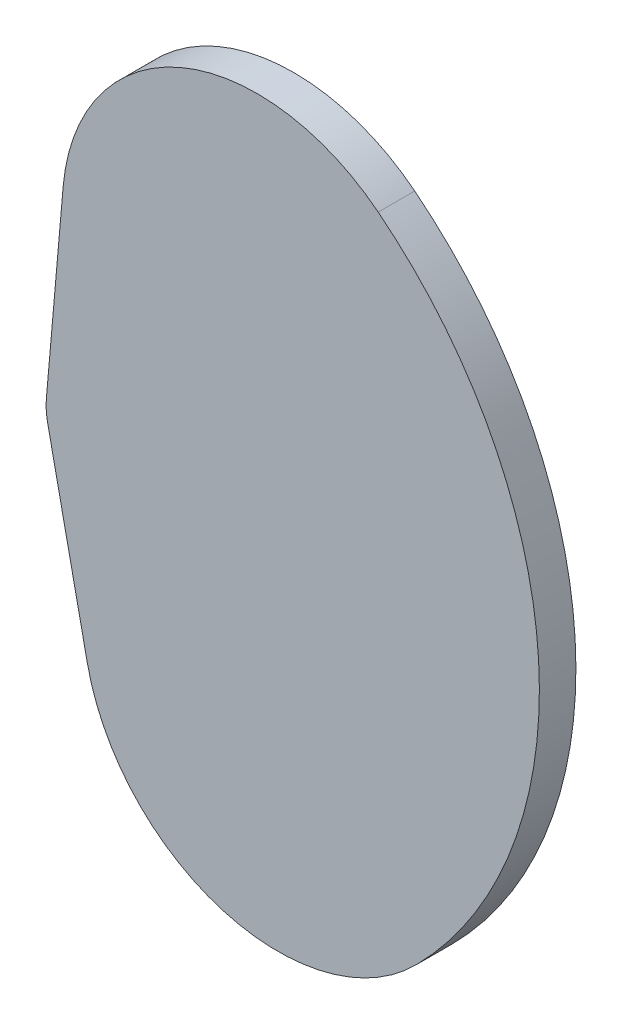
from build123d import *

# Parameters (mm, degrees)
EXTRUDE1_DEPTH = 19.05


with BuildPart() as part:
    # Sketch1 → Extrude1 (new body)
    with BuildSketch(Plane.XY):
        with BuildLine():
            Line((-99.573630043, -19.854408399), (-120.319413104, 78.422268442))
            ThreePointArc((-120.319413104, 78.422268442), (-121.017352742, 83.591190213), (-120.947256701, 88.806548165))
            Line((-120.947256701, 88.806548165), (-112.193117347, 188.866818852))
            ThreePointArc((-112.193117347, 188.866818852), (-106.321361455, 215.119265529), (-93.76563099, 238.910484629))
            ThreePointArc((-93.76563099, 238.910484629), (-25.26400352, 280.602648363), (52.136383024, 259.62910203))
            ThreePointArc((52.136383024, 259.62910203), (135.790291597, 99.118028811), (72.084370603, -70.302562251))
            ThreePointArc((72.084370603, -70.302562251), (-2.225273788, -100.44864381), (-75.251040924, -67.313363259))
            ThreePointArc((-75.251040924, -67.313363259), (-90.581712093, -45.208182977), (-99.573630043, -19.854408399))
        make_face()
    extrude(amount=EXTRUDE1_DEPTH)


solid = part.part
